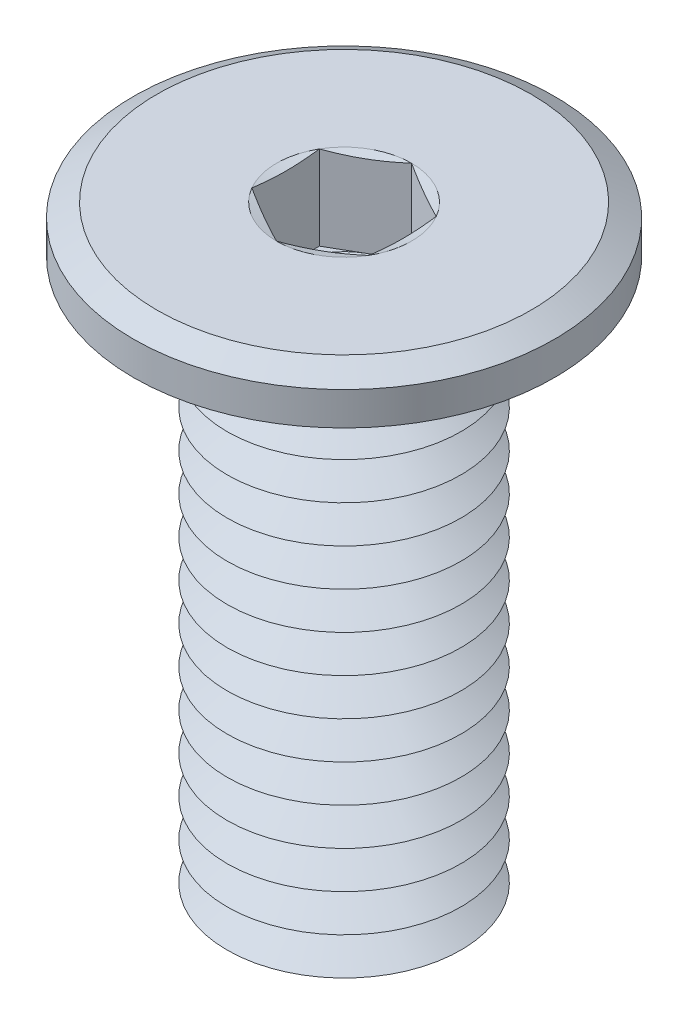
from build123d import *

# Parameters (mm, degrees)
SKETCH1_R           = 4.5
BOSS_EXTRUDE1_DEPTH = 1
SKETCH2_R           = 2.5
BOSS_EXTRUDE2_DEPTH = 12
LPATTERN1_COUNT     = 14
LPATTERN1_PITCH     = 0.8
FILLET1_R           = 0.2
CHAMFER2_SIZE       = 0.5
CHAMFER2_SIZE2      = 0.288675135
CUT_EXTRUDE1_DEPTH  = 1.8


with BuildPart() as part:
    # Sketch1 → Boss-Extrude1 (new body)
    with BuildSketch(Plane(origin=(0, 0, 0), x_dir=(1, 0, 0), z_dir=(0, 1, 0))):
        with Locations(Location((0, 0, 0), (0, 0, 270))):
            Circle(SKETCH1_R)
    extrude(amount=-BOSS_EXTRUDE1_DEPTH)

    # Sketch2 → Boss-Extrude2 (add)
    with BuildSketch(Plane.XZ.offset(1)):
        with Locations(Location((0, 0, 0), (0, 0, 270))):
            Circle(SKETCH2_R)
    extrude(amount=BOSS_EXTRUDE2_DEPTH)

    # Sketch5 → Cut-Revolve1 (revolve, cut)
    with BuildSketch(Plane(origin=(0, 0, 0), x_dir=(0, 0, -1), z_dir=(1, 0, 0))):
        Polygon((-2.5, -13.4), (-1.807179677, -13), (-2.5, -12.6), align=None)
    cut_revolve1 = revolve(axis=Axis((0, 0.990593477, 0), (0, -1, 0)), mode=Mode.SUBTRACT)

    # LPattern1: Cut-Revolve1 ×14
    with Locations(*[(0, i * LPATTERN1_PITCH, 0) for i in range(1, LPATTERN1_COUNT)]):
        add(cut_revolve1, mode=Mode.SUBTRACT)

    # Fillet1
    fillet1_edges = [part.edges().sort_by_distance(p)[0] for p in [
        (0, -1, 2.5),
    ]]
    fillet(fillet1_edges, radius=FILLET1_R)

    # Chamfer2
    chamfer2_edges = [part.edges().sort_by_distance(p)[0] for p in [
        (0, 0, -4.5),
    ]]
    chamfer2_side = [part.faces().sort_by_distance(p)[0] for p in [
        (0, 0, 0),
    ]]
    chamfer(chamfer2_edges, length=CHAMFER2_SIZE, length2=CHAMFER2_SIZE2, reference=chamfer2_side[0])

    # Sketch6 → Cut-Extrude1 (cut)
    with BuildSketch(Plane(origin=(0, 0, 0), x_dir=(1, 0, 0), z_dir=(0, 1, 0))):
        Polygon((0, 1.443375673), (-1.25, 0.721687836), (-1.25, -0.721687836), (0, -1.443375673), (1.25, -0.721687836), (1.25, 0.721687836), align=None)
    extrude(amount=-CUT_EXTRUDE1_DEPTH, mode=Mode.SUBTRACT)

    # Cut-Extrude2 cone 1 section (on through the dimple's axis) → Cut-Extrude2 (revolve, cut)
    with BuildSketch(Plane(origin=(0, -1.8, 0), x_dir=(0, 0, 1), z_dir=(1, 0, 0))):
        Polygon((0, 0), (1.25, 0), (0, 0.721687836), align=None)
    revolve(axis=Axis((0, -1.8, 0), (0, -1, 0)), mode=Mode.SUBTRACT)

    # Cut-Extrude3 cone 1 section (on through the dimple's axis) → Cut-Extrude3 (revolve, cut)
    with BuildSketch(Plane(origin=(0, 0, 0), x_dir=(0, 0, 1), z_dir=(1, 0, 0))):
        Polygon((0, 0), (1.443375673, 0), (0, 0.386751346), align=None)
    revolve(axis=Axis((0, 0, 0), (0, -1, 0)), mode=Mode.SUBTRACT)


solid = part.part
